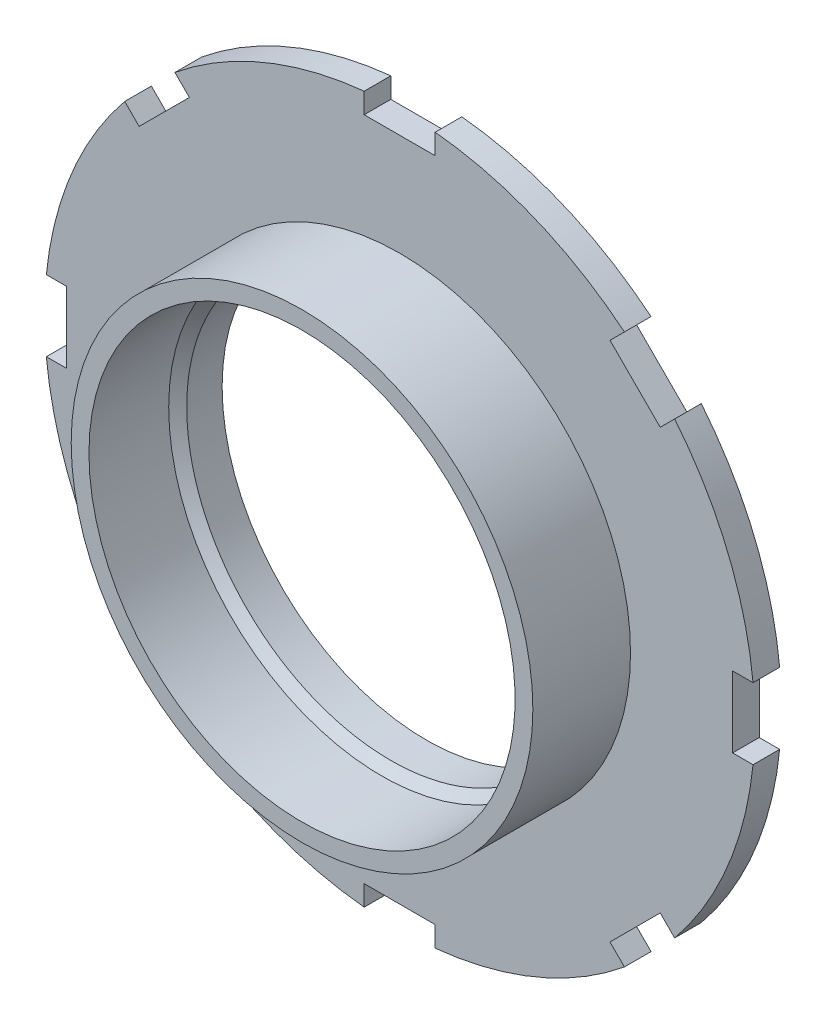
ISO-10303-21;
HEADER;
FILE_DESCRIPTION(('STEP AP214'),'2;1');
FILE_NAME('part.step','',(''),(''),'','','');
FILE_SCHEMA(('AUTOMOTIVE_DESIGN { 1 0 10303 214 1 1 1 1 }'));
ENDSEC;
DATA;
#1=APPLICATION_CONTEXT('core data for automotive mechanical design processes');
#2=APPLICATION_PROTOCOL_DEFINITION('international standard','automotive_design',2000,#1);
#3=PRODUCT_CONTEXT('',#1,'mechanical');
#4=PRODUCT('Part','Part','',(#3));
#5=PRODUCT_RELATED_PRODUCT_CATEGORY('part','',(#4));
#6=PRODUCT_DEFINITION_FORMATION('','',#4);
#7=PRODUCT_DEFINITION_CONTEXT('part definition',#1,'design');
#8=PRODUCT_DEFINITION('design','',#6,#7);
#9=PRODUCT_DEFINITION_SHAPE('','',#8);
#10=(LENGTH_UNIT() NAMED_UNIT(*) SI_UNIT(.MILLI.,.METRE.));
#11=(NAMED_UNIT(*) PLANE_ANGLE_UNIT() SI_UNIT($,.RADIAN.));
#12=(NAMED_UNIT(*) SI_UNIT($,.STERADIAN.) SOLID_ANGLE_UNIT());
#13=UNCERTAINTY_MEASURE_WITH_UNIT(LENGTH_MEASURE(1.E-05),#10,'distance_accuracy_value','');
#14=(GEOMETRIC_REPRESENTATION_CONTEXT(3) GLOBAL_UNCERTAINTY_ASSIGNED_CONTEXT((#13)) GLOBAL_UNIT_ASSIGNED_CONTEXT((#10,
#11,#12)) REPRESENTATION_CONTEXT('',''));
#15=CARTESIAN_POINT('',(0.,0.,0.));
#16=DIRECTION('',(0.,0.,1.));
#17=DIRECTION('',(1.,0.,0.));
#18=AXIS2_PLACEMENT_3D('',#15,#16,#17);
#19=CARTESIAN_POINT('',(0.,0.,14.));
#20=DIRECTION('',(0.,0.,-1.));
#21=DIRECTION('',(-1.,0.,0.));
#22=AXIS2_PLACEMENT_3D('',#19,#20,#21);
#23=CYLINDRICAL_SURFACE('',#22,24.);
#24=CARTESIAN_POINT('',(0.,0.,14.));
#25=DIRECTION('',(0.,0.,-1.));
#26=DIRECTION('',(-1.,0.,0.));
#27=AXIS2_PLACEMENT_3D('',#24,#25,#26);
#28=CIRCLE('',#27,24.);
#29=CARTESIAN_POINT('',(-24.,0.,14.));
#30=VERTEX_POINT('',#29);
#31=EDGE_CURVE('E414',#30,#30,#28,.T.);
#32=CARTESIAN_POINT('',(0.,0.,5.01666609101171));
#33=DIRECTION('',(0.,0.,1.));
#34=DIRECTION('',(1.,0.,0.));
#35=AXIS2_PLACEMENT_3D('',#32,#33,#34);
#36=CIRCLE('',#35,24.);
#37=CARTESIAN_POINT('',(-24.,0.,5.01666609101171));
#38=VERTEX_POINT('',#37);
#39=EDGE_CURVE('E11',#38,#38,#36,.T.);
#40=CARTESIAN_POINT('',(-24.,0.,14.));
#41=CARTESIAN_POINT('',(-24.,0.,13.9064236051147));
#42=CARTESIAN_POINT('',(-24.,0.,13.8128472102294));
#43=CARTESIAN_POINT('',(-24.,0.,13.6256944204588));
#44=CARTESIAN_POINT('',(-24.,0.,13.5321180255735));
#45=CARTESIAN_POINT('',(-24.,0.,13.3449652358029));
#46=CARTESIAN_POINT('',(-24.,0.,13.2513888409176));
#47=CARTESIAN_POINT('',(-24.,0.,13.0642360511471));
#48=CARTESIAN_POINT('',(-24.,0.,12.9706596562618));
#49=CARTESIAN_POINT('',(-24.,0.,12.7835068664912));
#50=CARTESIAN_POINT('',(-24.,0.,12.6899304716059));
#51=CARTESIAN_POINT('',(-24.,0.,12.5027776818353));
#52=CARTESIAN_POINT('',(-24.,0.,12.40920128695));
#53=CARTESIAN_POINT('',(-24.,0.,12.2220484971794));
#54=CARTESIAN_POINT('',(-24.,0.,12.1284721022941));
#55=CARTESIAN_POINT('',(-24.,0.,11.9413193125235));
#56=CARTESIAN_POINT('',(-24.,0.,11.8477429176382));
#57=CARTESIAN_POINT('',(-24.,0.,11.6605901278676));
#58=CARTESIAN_POINT('',(-24.,0.,11.5670137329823));
#59=CARTESIAN_POINT('',(-24.,0.,11.3798609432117));
#60=CARTESIAN_POINT('',(-24.,0.,11.2862845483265));
#61=CARTESIAN_POINT('',(-24.,0.,11.0991317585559));
#62=CARTESIAN_POINT('',(-24.,0.,11.0055553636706));
#63=CARTESIAN_POINT('',(-24.,0.,10.8184025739));
#64=CARTESIAN_POINT('',(-24.,0.,10.7248261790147));
#65=CARTESIAN_POINT('',(-24.,0.,10.5376733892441));
#66=CARTESIAN_POINT('',(-24.,0.,10.4440969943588));
#67=CARTESIAN_POINT('',(-24.,0.,10.2569442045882));
#68=CARTESIAN_POINT('',(-24.,0.,10.1633678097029));
#69=CARTESIAN_POINT('',(-24.,0.,9.97621501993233));
#70=CARTESIAN_POINT('',(-24.,0.,9.88263862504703));
#71=CARTESIAN_POINT('',(-24.,0.,9.69548583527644));
#72=CARTESIAN_POINT('',(-24.,0.,9.60190944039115));
#73=CARTESIAN_POINT('',(-24.,0.,9.41475665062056));
#74=CARTESIAN_POINT('',(-24.,0.,9.32118025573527));
#75=CARTESIAN_POINT('',(-24.,0.,9.13402746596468));
#76=CARTESIAN_POINT('',(-24.,0.,9.04045107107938));
#77=CARTESIAN_POINT('',(-24.,0.,8.85329828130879));
#78=CARTESIAN_POINT('',(-24.,0.,8.7597218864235));
#79=CARTESIAN_POINT('',(-24.,0.,8.57256909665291));
#80=CARTESIAN_POINT('',(-24.,0.,8.47899270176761));
#81=CARTESIAN_POINT('',(-24.,0.,8.29183991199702));
#82=CARTESIAN_POINT('',(-24.,0.,8.19826351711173));
#83=CARTESIAN_POINT('',(-24.,0.,8.01111072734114));
#84=CARTESIAN_POINT('',(-24.,0.,7.91753433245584));
#85=CARTESIAN_POINT('',(-24.,0.,7.73038154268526));
#86=CARTESIAN_POINT('',(-24.,0.,7.63680514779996));
#87=CARTESIAN_POINT('',(-24.,0.,7.44965235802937));
#88=CARTESIAN_POINT('',(-24.,0.,7.35607596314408));
#89=CARTESIAN_POINT('',(-24.,0.,7.16892317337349));
#90=CARTESIAN_POINT('',(-24.,0.,7.07534677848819));
#91=CARTESIAN_POINT('',(-24.,0.,6.8881939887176));
#92=CARTESIAN_POINT('',(-24.,0.,6.79461759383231));
#93=CARTESIAN_POINT('',(-24.,0.,6.60746480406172));
#94=CARTESIAN_POINT('',(-24.,0.,6.51388840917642));
#95=CARTESIAN_POINT('',(-24.,0.,6.32673561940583));
#96=CARTESIAN_POINT('',(-24.,0.,6.23315922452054));
#97=CARTESIAN_POINT('',(-24.,0.,6.04600643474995));
#98=CARTESIAN_POINT('',(-24.,0.,5.95243003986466));
#99=CARTESIAN_POINT('',(-24.,0.,5.76527725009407));
#100=CARTESIAN_POINT('',(-24.,0.,5.67170085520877));
#101=CARTESIAN_POINT('',(-24.,0.,5.48454806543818));
#102=CARTESIAN_POINT('',(-24.,0.,5.39097167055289));
#103=CARTESIAN_POINT('',(-24.,0.,5.2038188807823));
#104=CARTESIAN_POINT('',(-24.,0.,5.110242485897));
#105=CARTESIAN_POINT('',(-24.,0.,5.01666609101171));
#106=B_SPLINE_CURVE_WITH_KNOTS('',3,(#40,#41,#42,#43,#44,#45,#46,#47,#48,#49,#50,#51,#52,#53,
#54,#55,#56,#57,#58,#59,#60,#61,#62,#63,#64,#65,#66,#67,#68,#69,#70,#71,#72,#73,#74,#75,#76,#77,
#78,#79,#80,#81,#82,#83,#84,#85,#86,#87,#88,#89,#90,#91,#92,#93,#94,#95,#96,#97,#98,#99,#100,
#101,#102,#103,#104,#105),.UNSPECIFIED.,.F.,.F.,(4,2,2,2,2,2,2,2,2,2,2,2,2,2,2,2,2,2,2,2,2,2,2,
2,2,2,2,2,2,2,2,2,4),(0.,0.280729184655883,0.561458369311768,0.842187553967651,1.12291673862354,
1.40364592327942,1.6843751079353,1.96510429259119,2.24583347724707,2.52656266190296,
2.80729184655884,3.08802103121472,3.36875021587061,3.64947940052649,3.93020858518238,
4.21093776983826,4.49166695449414,4.77239613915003,5.05312532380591,5.3338545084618,
5.61458369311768,5.89531287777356,6.17604206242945,6.45677124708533,6.73750043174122,
7.0182296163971,7.29895880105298,7.57968798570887,7.86041717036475,8.14114635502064,
8.42187553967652,8.7026047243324,8.98333390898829),.UNSPECIFIED.);
#107=EDGE_CURVE('BSEAM31',#30,#38,#106,.T.);
#108=ORIENTED_EDGE('',*,*,#31,.F.);
#109=ORIENTED_EDGE('',*,*,#39,.F.);
#110=ORIENTED_EDGE('',*,*,#107,.T.);
#111=ORIENTED_EDGE('',*,*,#107,.F.);
#112=EDGE_LOOP('',(#108,#110,#109,#111));
#113=FACE_BOUND('',#112,.T.);
#114=ADVANCED_FACE('F31',(#113),#23,.F.);
#115=CARTESIAN_POINT('',(0.,0.,3.));
#116=DIRECTION('',(0.,0.,1.));
#117=DIRECTION('',(1.,0.,0.));
#118=AXIS2_PLACEMENT_3D('',#115,#116,#117);
#119=PLANE('',#118);
#120=CARTESIAN_POINT('',(0.,0.,3.));
#121=DIRECTION('',(0.,0.,1.));
#122=DIRECTION('',(1.,0.,0.));
#123=AXIS2_PLACEMENT_3D('',#120,#121,#122);
#124=CIRCLE('',#123,26.);
#125=CARTESIAN_POINT('',(26.,0.,3.));
#126=VERTEX_POINT('',#125);
#127=EDGE_CURVE('E417',#126,#126,#124,.T.);
#128=ORIENTED_EDGE('',*,*,#127,.F.);
#129=EDGE_LOOP('',(#128));
#130=FACE_BOUND('',#129,.T.);
#131=CARTESIAN_POINT('',(0.,0.,3.));
#132=DIRECTION('',(0.,0.,1.));
#133=DIRECTION('',(1.,0.,0.));
#134=AXIS2_PLACEMENT_3D('',#131,#132,#133);
#135=CIRCLE('',#134,40.);
#136=CARTESIAN_POINT('',(-4.,39.7994974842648,3.));
#137=VERTEX_POINT('',#136);
#138=CARTESIAN_POINT('',(-25.314067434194,30.9709216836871,3.));
#139=VERTEX_POINT('',#138);
#140=EDGE_CURVE('E425',#137,#139,#135,.T.);
#141=ORIENTED_EDGE('',*,*,#140,.T.);
#142=DIRECTION('',(0.707106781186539,-0.707106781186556,0.));
#143=VECTOR('',#142,1.);
#144=CARTESIAN_POINT('',(2.82842712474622,2.82842712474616,3.));
#145=LINE('',#144,#143);
#146=CARTESIAN_POINT('',(-23.688077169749,29.344931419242,3.));
#147=VERTEX_POINT('',#146);
#148=EDGE_CURVE('E46',#139,#147,#145,.T.);
#149=ORIENTED_EDGE('',*,*,#148,.T.);
#150=DIRECTION('',(-0.707106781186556,-0.707106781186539,0.));
#151=VECTOR('',#150,1.);
#152=CARTESIAN_POINT('',(-26.5165042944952,26.5165042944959,3.));
#153=LINE('',#152,#151);
#154=CARTESIAN_POINT('',(-29.3449314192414,23.6880771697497,3.));
#155=VERTEX_POINT('',#154);
#156=EDGE_CURVE('E50',#147,#155,#153,.T.);
#157=ORIENTED_EDGE('',*,*,#156,.T.);
#158=DIRECTION('',(-0.707106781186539,0.707106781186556,0.));
#159=VECTOR('',#158,1.);
#160=CARTESIAN_POINT('',(-2.82842712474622,-2.82842712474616,3.));
#161=LINE('',#160,#159);
#162=CARTESIAN_POINT('',(-30.9709216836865,25.3140674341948,3.));
#163=VERTEX_POINT('',#162);
#164=EDGE_CURVE('E282',#155,#163,#161,.T.);
#165=ORIENTED_EDGE('',*,*,#164,.T.);
#166=CARTESIAN_POINT('',(-39.7994974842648,4.00000000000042,3.));
#167=VERTEX_POINT('',#166);
#168=EDGE_CURVE('E257',#163,#167,#135,.T.);
#169=ORIENTED_EDGE('',*,*,#168,.T.);
#170=DIRECTION('',(1.,0.,0.));
#171=VECTOR('',#170,1.);
#172=CARTESIAN_POINT('',(0.,4.,3.));
#173=LINE('',#172,#171);
#174=CARTESIAN_POINT('',(-37.5,4.00000000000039,3.));
#175=VERTEX_POINT('',#174);
#176=EDGE_CURVE('E304',#167,#175,#173,.T.);
#177=ORIENTED_EDGE('',*,*,#176,.T.);
#178=DIRECTION('',(0.,-1.,0.));
#179=VECTOR('',#178,1.);
#180=CARTESIAN_POINT('',(-37.5,3.92791878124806E-13,3.));
#181=LINE('',#180,#179);
#182=CARTESIAN_POINT('',(-37.5,-3.99999999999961,3.));
#183=VERTEX_POINT('',#182);
#184=EDGE_CURVE('E302',#175,#183,#181,.T.);
#185=ORIENTED_EDGE('',*,*,#184,.T.);
#186=DIRECTION('',(-1.,0.,0.));
#187=VECTOR('',#186,1.);
#188=CARTESIAN_POINT('',(0.,-4.,3.));
#189=LINE('',#188,#187);
#190=CARTESIAN_POINT('',(-39.7994974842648,-3.99999999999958,3.));
#191=VERTEX_POINT('',#190);
#192=EDGE_CURVE('E300',#183,#191,#189,.T.);
#193=ORIENTED_EDGE('',*,*,#192,.T.);
#194=CARTESIAN_POINT('',(-30.970921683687,-25.3140674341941,3.));
#195=VERTEX_POINT('',#194);
#196=EDGE_CURVE('E495',#191,#195,#135,.T.);
#197=ORIENTED_EDGE('',*,*,#196,.T.);
#198=DIRECTION('',(0.707106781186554,0.707106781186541,0.));
#199=VECTOR('',#198,1.);
#200=CARTESIAN_POINT('',(-2.82842712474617,2.82842712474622,3.));
#201=LINE('',#200,#199);
#202=CARTESIAN_POINT('',(-29.3449314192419,-23.6880771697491,3.));
#203=VERTEX_POINT('',#202);
#204=EDGE_CURVE('E322',#195,#203,#201,.T.);
#205=ORIENTED_EDGE('',*,*,#204,.T.);
#206=DIRECTION('',(0.707106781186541,-0.707106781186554,0.));
#207=VECTOR('',#206,1.);
#208=CARTESIAN_POINT('',(-26.5165042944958,-26.5165042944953,3.));
#209=LINE('',#208,#207);
#210=CARTESIAN_POINT('',(-23.6880771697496,-29.3449314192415,3.));
#211=VERTEX_POINT('',#210);
#212=EDGE_CURVE('E320',#203,#211,#209,.T.);
#213=ORIENTED_EDGE('',*,*,#212,.T.);
#214=DIRECTION('',(-0.707106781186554,-0.707106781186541,0.));
#215=VECTOR('',#214,1.);
#216=CARTESIAN_POINT('',(2.82842712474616,-2.82842712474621,3.));
#217=LINE('',#216,#215);
#218=CARTESIAN_POINT('',(-25.3140674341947,-30.9709216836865,3.));
#219=VERTEX_POINT('',#218);
#220=EDGE_CURVE('E318',#211,#219,#217,.T.);
#221=ORIENTED_EDGE('',*,*,#220,.T.);
#222=CARTESIAN_POINT('',(-4.00000000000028,-39.7994974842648,3.));
#223=VERTEX_POINT('',#222);
#224=EDGE_CURVE('E500',#219,#223,#135,.T.);
#225=ORIENTED_EDGE('',*,*,#224,.T.);
#226=DIRECTION('',(0.,1.,0.));
#227=VECTOR('',#226,1.);
#228=CARTESIAN_POINT('',(-4.,0.,3.));
#229=LINE('',#228,#227);
#230=CARTESIAN_POINT('',(-4.00000000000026,-37.5,3.));
#231=VERTEX_POINT('',#230);
#232=EDGE_CURVE('E340',#223,#231,#229,.T.);
#233=ORIENTED_EDGE('',*,*,#232,.T.);
#234=DIRECTION('',(1.,0.,0.));
#235=VECTOR('',#234,1.);
#236=CARTESIAN_POINT('',(-2.61861252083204E-13,-37.5,3.));
#237=LINE('',#236,#235);
#238=CARTESIAN_POINT('',(3.99999999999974,-37.5,3.));
#239=VERTEX_POINT('',#238);
#240=EDGE_CURVE('E338',#231,#239,#237,.T.);
#241=ORIENTED_EDGE('',*,*,#240,.T.);
#242=DIRECTION('',(0.,-1.,0.));
#243=VECTOR('',#242,1.);
#244=CARTESIAN_POINT('',(4.,0.,3.));
#245=LINE('',#244,#243);
#246=CARTESIAN_POINT('',(3.99999999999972,-39.7994974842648,3.));
#247=VERTEX_POINT('',#246);
#248=EDGE_CURVE('E336',#239,#247,#245,.T.);
#249=ORIENTED_EDGE('',*,*,#248,.T.);
#250=CARTESIAN_POINT('',(25.3140674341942,-30.9709216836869,3.));
#251=VERTEX_POINT('',#250);
#252=EDGE_CURVE('E501',#247,#251,#135,.T.);
#253=ORIENTED_EDGE('',*,*,#252,.T.);
#254=DIRECTION('',(-0.707106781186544,0.707106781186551,0.));
#255=VECTOR('',#254,1.);
#256=CARTESIAN_POINT('',(-2.8284271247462,-2.82842712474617,3.));
#257=LINE('',#256,#255);
#258=CARTESIAN_POINT('',(23.6880771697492,-29.3449314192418,3.));
#259=VERTEX_POINT('',#258);
#260=EDGE_CURVE('E358',#251,#259,#257,.T.);
#261=ORIENTED_EDGE('',*,*,#260,.T.);
#262=DIRECTION('',(0.707106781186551,0.707106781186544,0.));
#263=VECTOR('',#262,1.);
#264=CARTESIAN_POINT('',(26.5165042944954,-26.5165042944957,3.));
#265=LINE('',#264,#263);
#266=CARTESIAN_POINT('',(29.3449314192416,-23.6880771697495,3.));
#267=VERTEX_POINT('',#266);
#268=EDGE_CURVE('E356',#259,#267,#265,.T.);
#269=ORIENTED_EDGE('',*,*,#268,.T.);
#270=DIRECTION('',(0.707106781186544,-0.707106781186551,0.));
#271=VECTOR('',#270,1.);
#272=CARTESIAN_POINT('',(2.82842712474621,2.82842712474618,3.));
#273=LINE('',#272,#271);
#274=CARTESIAN_POINT('',(30.9709216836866,-25.3140674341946,3.));
#275=VERTEX_POINT('',#274);
#276=EDGE_CURVE('E354',#267,#275,#273,.T.);
#277=ORIENTED_EDGE('',*,*,#276,.T.);
#278=CARTESIAN_POINT('',(39.7994974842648,-4.00000000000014,3.));
#279=VERTEX_POINT('',#278);
#280=EDGE_CURVE('E503',#275,#279,#135,.T.);
#281=ORIENTED_EDGE('',*,*,#280,.T.);
#282=DIRECTION('',(-1.,0.,0.));
#283=VECTOR('',#282,1.);
#284=CARTESIAN_POINT('',(0.,-4.,3.));
#285=LINE('',#284,#283);
#286=CARTESIAN_POINT('',(37.5,-4.00000000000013,3.));
#287=VERTEX_POINT('',#286);
#288=EDGE_CURVE('E376',#279,#287,#285,.T.);
#289=ORIENTED_EDGE('',*,*,#288,.T.);
#290=DIRECTION('',(0.,1.,0.));
#291=VECTOR('',#290,1.);
#292=CARTESIAN_POINT('',(37.5,-1.30930626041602E-13,3.));
#293=LINE('',#292,#291);
#294=CARTESIAN_POINT('',(37.5,3.99999999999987,3.));
#295=VERTEX_POINT('',#294);
#296=EDGE_CURVE('E374',#287,#295,#293,.T.);
#297=ORIENTED_EDGE('',*,*,#296,.T.);
#298=DIRECTION('',(1.,0.,0.));
#299=VECTOR('',#298,1.);
#300=CARTESIAN_POINT('',(0.,4.,3.));
#301=LINE('',#300,#299);
#302=CARTESIAN_POINT('',(39.7994974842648,3.99999999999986,3.));
#303=VERTEX_POINT('',#302);
#304=EDGE_CURVE('E372',#295,#303,#301,.T.);
#305=ORIENTED_EDGE('',*,*,#304,.T.);
#306=CARTESIAN_POINT('',(30.9709216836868,25.3140674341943,3.));
#307=VERTEX_POINT('',#306);
#308=EDGE_CURVE('E505',#303,#307,#135,.T.);
#309=ORIENTED_EDGE('',*,*,#308,.T.);
#310=DIRECTION('',(-0.707106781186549,-0.707106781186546,0.));
#311=VECTOR('',#310,1.);
#312=CARTESIAN_POINT('',(2.82842712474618,-2.82842712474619,3.));
#313=LINE('',#312,#311);
#314=CARTESIAN_POINT('',(29.3449314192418,23.6880771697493,3.));
#315=VERTEX_POINT('',#314);
#316=EDGE_CURVE('E394',#307,#315,#313,.T.);
#317=ORIENTED_EDGE('',*,*,#316,.T.);
#318=DIRECTION('',(-0.707106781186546,0.707106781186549,0.));
#319=VECTOR('',#318,1.);
#320=CARTESIAN_POINT('',(26.5165042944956,26.5165042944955,3.));
#321=LINE('',#320,#319);
#322=CARTESIAN_POINT('',(23.6880771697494,29.3449314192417,3.));
#323=VERTEX_POINT('',#322);
#324=EDGE_CURVE('E392',#315,#323,#321,.T.);
#325=ORIENTED_EDGE('',*,*,#324,.T.);
#326=DIRECTION('',(0.707106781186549,0.707106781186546,0.));
#327=VECTOR('',#326,1.);
#328=CARTESIAN_POINT('',(-2.82842712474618,2.82842712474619,3.));
#329=LINE('',#328,#327);
#330=CARTESIAN_POINT('',(25.3140674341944,30.9709216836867,3.));
#331=VERTEX_POINT('',#330);
#332=EDGE_CURVE('E390',#323,#331,#329,.T.);
#333=ORIENTED_EDGE('',*,*,#332,.T.);
#334=CARTESIAN_POINT('',(4.,39.7994974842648,3.));
#335=VERTEX_POINT('',#334);
#336=EDGE_CURVE('E424',#331,#335,#135,.T.);
#337=ORIENTED_EDGE('',*,*,#336,.T.);
#338=DIRECTION('',(0.,-1.,0.));
#339=VECTOR('',#338,1.);
#340=CARTESIAN_POINT('',(4.,0.,3.));
#341=LINE('',#340,#339);
#342=CARTESIAN_POINT('',(4.,37.5,3.));
#343=VERTEX_POINT('',#342);
#344=EDGE_CURVE('E412',#335,#343,#341,.T.);
#345=ORIENTED_EDGE('',*,*,#344,.T.);
#346=DIRECTION('',(-1.,0.,0.));
#347=VECTOR('',#346,1.);
#348=CARTESIAN_POINT('',(0.,37.5,3.));
#349=LINE('',#348,#347);
#350=CARTESIAN_POINT('',(-4.,37.5,3.));
#351=VERTEX_POINT('',#350);
#352=EDGE_CURVE('E410',#343,#351,#349,.T.);
#353=ORIENTED_EDGE('',*,*,#352,.T.);
#354=DIRECTION('',(0.,1.,0.));
#355=VECTOR('',#354,1.);
#356=CARTESIAN_POINT('',(-4.,0.,3.));
#357=LINE('',#356,#355);
#358=EDGE_CURVE('E408',#351,#137,#357,.T.);
#359=ORIENTED_EDGE('',*,*,#358,.T.);
#360=EDGE_LOOP('',(#141,#149,#157,#165,#169,#177,#185,#193,#197,#205,#213,#221,#225,#233,#241,
#249,#253,#261,#269,#277,#281,#289,#297,#305,#309,#317,#325,#333,#337,#345,#353,#359));
#361=FACE_BOUND('',#360,.T.);
#362=ADVANCED_FACE('F494',(#130,#361),#119,.T.);
#363=CARTESIAN_POINT('',(0.,0.,3.));
#364=DIRECTION('',(0.,0.,-1.));
#365=DIRECTION('',(-1.,0.,0.));
#366=AXIS2_PLACEMENT_3D('',#363,#364,#365);
#367=CYLINDRICAL_SURFACE('',#366,40.);
#368=DIRECTION('',(0.,0.,1.));
#369=VECTOR('',#368,1.);
#370=CARTESIAN_POINT('',(-25.314067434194,30.9709216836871,-146.074232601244));
#371=LINE('',#370,#369);
#372=CARTESIAN_POINT('',(-25.314067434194,30.9709216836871,0.));
#373=VERTEX_POINT('',#372);
#374=EDGE_CURVE('E277',#373,#139,#371,.T.);
#375=ORIENTED_EDGE('',*,*,#374,.T.);
#376=ORIENTED_EDGE('',*,*,#140,.F.);
#377=DIRECTION('',(0.,0.,1.));
#378=VECTOR('',#377,1.);
#379=CARTESIAN_POINT('',(-4.,39.7994974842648,-146.25));
#380=LINE('',#379,#378);
#381=CARTESIAN_POINT('',(-4.,39.7994974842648,0.));
#382=VERTEX_POINT('',#381);
#383=EDGE_CURVE('E397',#382,#137,#380,.T.);
#384=ORIENTED_EDGE('',*,*,#383,.F.);
#385=CARTESIAN_POINT('',(0.,0.,0.));
#386=DIRECTION('',(0.,0.,1.));
#387=DIRECTION('',(1.,0.,0.));
#388=AXIS2_PLACEMENT_3D('',#385,#386,#387);
#389=CIRCLE('',#388,40.);
#390=EDGE_CURVE('E250',#382,#373,#389,.T.);
#391=ORIENTED_EDGE('',*,*,#390,.T.);
#392=EDGE_LOOP('',(#375,#376,#384,#391));
#393=FACE_BOUND('',#392,.T.);
#394=ADVANCED_FACE('F33',(#393),#367,.T.);
#395=DIRECTION('',(0.,0.,1.));
#396=VECTOR('',#395,1.);
#397=CARTESIAN_POINT('',(-30.9709216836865,25.3140674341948,-146.074232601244));
#398=LINE('',#397,#396);
#399=CARTESIAN_POINT('',(-30.9709216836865,25.3140674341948,0.));
#400=VERTEX_POINT('',#399);
#401=EDGE_CURVE('E255',#400,#163,#398,.T.);
#402=ORIENTED_EDGE('',*,*,#401,.F.);
#403=CARTESIAN_POINT('',(-39.7994974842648,4.00000000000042,0.));
#404=VERTEX_POINT('',#403);
#405=EDGE_CURVE('E238',#400,#404,#389,.T.);
#406=ORIENTED_EDGE('',*,*,#405,.T.);
#407=DIRECTION('',(0.,0.,1.));
#408=VECTOR('',#407,1.);
#409=CARTESIAN_POINT('',(-39.7994974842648,4.00000000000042,-146.074232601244));
#410=LINE('',#409,#408);
#411=EDGE_CURVE('E298',#404,#167,#410,.T.);
#412=ORIENTED_EDGE('',*,*,#411,.T.);
#413=ORIENTED_EDGE('',*,*,#168,.F.);
#414=EDGE_LOOP('',(#402,#406,#412,#413));
#415=FACE_BOUND('',#414,.T.);
#416=ADVANCED_FACE('F256',(#415),#367,.T.);
#417=CARTESIAN_POINT('',(0.,0.,0.));
#418=DIRECTION('',(0.,0.,1.));
#419=DIRECTION('',(1.,0.,0.));
#420=AXIS2_PLACEMENT_3D('',#417,#418,#419);
#421=PLANE('',#420);
#422=DIRECTION('',(0.707106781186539,-0.707106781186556,0.));
#423=VECTOR('',#422,1.);
#424=CARTESIAN_POINT('',(2.82842712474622,2.82842712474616,0.));
#425=LINE('',#424,#423);
#426=CARTESIAN_POINT('',(-23.688077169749,29.344931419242,0.));
#427=VERTEX_POINT('',#426);
#428=EDGE_CURVE('E39',#373,#427,#425,.T.);
#429=ORIENTED_EDGE('',*,*,#428,.F.);
#430=ORIENTED_EDGE('',*,*,#390,.F.);
#431=DIRECTION('',(0.,1.,0.));
#432=VECTOR('',#431,1.);
#433=CARTESIAN_POINT('',(-4.,0.,0.));
#434=LINE('',#433,#432);
#435=CARTESIAN_POINT('',(-4.,37.5,0.));
#436=VERTEX_POINT('',#435);
#437=EDGE_CURVE('E427',#436,#382,#434,.T.);
#438=ORIENTED_EDGE('',*,*,#437,.F.);
#439=DIRECTION('',(-1.,0.,0.));
#440=VECTOR('',#439,1.);
#441=CARTESIAN_POINT('',(0.,37.5,0.));
#442=LINE('',#441,#440);
#443=CARTESIAN_POINT('',(4.,37.5,0.));
#444=VERTEX_POINT('',#443);
#445=EDGE_CURVE('E430',#444,#436,#442,.T.);
#446=ORIENTED_EDGE('',*,*,#445,.F.);
#447=DIRECTION('',(0.,-1.,0.));
#448=VECTOR('',#447,1.);
#449=CARTESIAN_POINT('',(4.,0.,0.));
#450=LINE('',#449,#448);
#451=CARTESIAN_POINT('',(4.,39.7994974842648,0.));
#452=VERTEX_POINT('',#451);
#453=EDGE_CURVE('E433',#452,#444,#450,.T.);
#454=ORIENTED_EDGE('',*,*,#453,.F.);
#455=CARTESIAN_POINT('',(25.3140674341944,30.9709216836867,0.));
#456=VERTEX_POINT('',#455);
#457=EDGE_CURVE('E422',#456,#452,#389,.T.);
#458=ORIENTED_EDGE('',*,*,#457,.F.);
#459=DIRECTION('',(0.707106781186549,0.707106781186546,0.));
#460=VECTOR('',#459,1.);
#461=CARTESIAN_POINT('',(-2.82842712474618,2.82842712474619,0.));
#462=LINE('',#461,#460);
#463=CARTESIAN_POINT('',(23.6880771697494,29.3449314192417,0.));
#464=VERTEX_POINT('',#463);
#465=EDGE_CURVE('E436',#464,#456,#462,.T.);
#466=ORIENTED_EDGE('',*,*,#465,.F.);
#467=DIRECTION('',(-0.707106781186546,0.707106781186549,0.));
#468=VECTOR('',#467,1.);
#469=CARTESIAN_POINT('',(26.5165042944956,26.5165042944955,0.));
#470=LINE('',#469,#468);
#471=CARTESIAN_POINT('',(29.3449314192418,23.6880771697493,0.));
#472=VERTEX_POINT('',#471);
#473=EDGE_CURVE('E439',#472,#464,#470,.T.);
#474=ORIENTED_EDGE('',*,*,#473,.F.);
#475=DIRECTION('',(-0.707106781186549,-0.707106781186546,0.));
#476=VECTOR('',#475,1.);
#477=CARTESIAN_POINT('',(2.82842712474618,-2.82842712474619,0.));
#478=LINE('',#477,#476);
#479=CARTESIAN_POINT('',(30.9709216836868,25.3140674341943,0.));
#480=VERTEX_POINT('',#479);
#481=EDGE_CURVE('E442',#480,#472,#478,.T.);
#482=ORIENTED_EDGE('',*,*,#481,.F.);
#483=CARTESIAN_POINT('',(39.7994974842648,3.99999999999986,0.));
#484=VERTEX_POINT('',#483);
#485=EDGE_CURVE('E529',#484,#480,#389,.T.);
#486=ORIENTED_EDGE('',*,*,#485,.F.);
#487=DIRECTION('',(1.,0.,0.));
#488=VECTOR('',#487,1.);
#489=CARTESIAN_POINT('',(0.,4.,0.));
#490=LINE('',#489,#488);
#491=CARTESIAN_POINT('',(37.5,3.99999999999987,0.));
#492=VERTEX_POINT('',#491);
#493=EDGE_CURVE('E445',#492,#484,#490,.T.);
#494=ORIENTED_EDGE('',*,*,#493,.F.);
#495=DIRECTION('',(0.,1.,0.));
#496=VECTOR('',#495,1.);
#497=CARTESIAN_POINT('',(37.5,-1.30930626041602E-13,0.));
#498=LINE('',#497,#496);
#499=CARTESIAN_POINT('',(37.5,-4.00000000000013,0.));
#500=VERTEX_POINT('',#499);
#501=EDGE_CURVE('E448',#500,#492,#498,.T.);
#502=ORIENTED_EDGE('',*,*,#501,.F.);
#503=DIRECTION('',(-1.,0.,0.));
#504=VECTOR('',#503,1.);
#505=CARTESIAN_POINT('',(0.,-4.,0.));
#506=LINE('',#505,#504);
#507=CARTESIAN_POINT('',(39.7994974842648,-4.00000000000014,0.));
#508=VERTEX_POINT('',#507);
#509=EDGE_CURVE('E451',#508,#500,#506,.T.);
#510=ORIENTED_EDGE('',*,*,#509,.F.);
#511=CARTESIAN_POINT('',(30.9709216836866,-25.3140674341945,0.));
#512=VERTEX_POINT('',#511);
#513=EDGE_CURVE('E545',#512,#508,#389,.T.);
#514=ORIENTED_EDGE('',*,*,#513,.F.);
#515=DIRECTION('',(0.707106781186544,-0.707106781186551,0.));
#516=VECTOR('',#515,1.);
#517=CARTESIAN_POINT('',(2.82842712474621,2.82842712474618,0.));
#518=LINE('',#517,#516);
#519=CARTESIAN_POINT('',(29.3449314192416,-23.6880771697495,0.));
#520=VERTEX_POINT('',#519);
#521=EDGE_CURVE('E454',#520,#512,#518,.T.);
#522=ORIENTED_EDGE('',*,*,#521,.F.);
#523=DIRECTION('',(0.707106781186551,0.707106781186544,0.));
#524=VECTOR('',#523,1.);
#525=CARTESIAN_POINT('',(26.5165042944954,-26.5165042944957,0.));
#526=LINE('',#525,#524);
#527=CARTESIAN_POINT('',(23.6880771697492,-29.3449314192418,0.));
#528=VERTEX_POINT('',#527);
#529=EDGE_CURVE('E457',#528,#520,#526,.T.);
#530=ORIENTED_EDGE('',*,*,#529,.F.);
#531=DIRECTION('',(-0.707106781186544,0.707106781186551,0.));
#532=VECTOR('',#531,1.);
#533=CARTESIAN_POINT('',(-2.8284271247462,-2.82842712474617,0.));
#534=LINE('',#533,#532);
#535=CARTESIAN_POINT('',(25.3140674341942,-30.9709216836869,0.));
#536=VERTEX_POINT('',#535);
#537=EDGE_CURVE('E460',#536,#528,#534,.T.);
#538=ORIENTED_EDGE('',*,*,#537,.F.);
#539=CARTESIAN_POINT('',(3.99999999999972,-39.7994974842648,0.));
#540=VERTEX_POINT('',#539);
#541=EDGE_CURVE('E546',#540,#536,#389,.T.);
#542=ORIENTED_EDGE('',*,*,#541,.F.);
#543=DIRECTION('',(0.,-1.,0.));
#544=VECTOR('',#543,1.);
#545=CARTESIAN_POINT('',(4.,0.,0.));
#546=LINE('',#545,#544);
#547=CARTESIAN_POINT('',(3.99999999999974,-37.5,0.));
#548=VERTEX_POINT('',#547);
#549=EDGE_CURVE('E463',#548,#540,#546,.T.);
#550=ORIENTED_EDGE('',*,*,#549,.F.);
#551=DIRECTION('',(1.,0.,0.));
#552=VECTOR('',#551,1.);
#553=CARTESIAN_POINT('',(-2.61861252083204E-13,-37.5,0.));
#554=LINE('',#553,#552);
#555=CARTESIAN_POINT('',(-4.00000000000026,-37.5,0.));
#556=VERTEX_POINT('',#555);
#557=EDGE_CURVE('E466',#556,#548,#554,.T.);
#558=ORIENTED_EDGE('',*,*,#557,.F.);
#559=DIRECTION('',(0.,1.,0.));
#560=VECTOR('',#559,1.);
#561=CARTESIAN_POINT('',(-4.,0.,0.));
#562=LINE('',#561,#560);
#563=CARTESIAN_POINT('',(-4.00000000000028,-39.7994974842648,0.));
#564=VERTEX_POINT('',#563);
#565=EDGE_CURVE('E469',#564,#556,#562,.T.);
#566=ORIENTED_EDGE('',*,*,#565,.F.);
#567=CARTESIAN_POINT('',(-25.3140674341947,-30.9709216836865,0.));
#568=VERTEX_POINT('',#567);
#569=EDGE_CURVE('E550',#568,#564,#389,.T.);
#570=ORIENTED_EDGE('',*,*,#569,.F.);
#571=DIRECTION('',(-0.707106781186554,-0.707106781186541,0.));
#572=VECTOR('',#571,1.);
#573=CARTESIAN_POINT('',(2.82842712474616,-2.82842712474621,0.));
#574=LINE('',#573,#572);
#575=CARTESIAN_POINT('',(-23.6880771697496,-29.3449314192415,0.));
#576=VERTEX_POINT('',#575);
#577=EDGE_CURVE('E472',#576,#568,#574,.T.);
#578=ORIENTED_EDGE('',*,*,#577,.F.);
#579=DIRECTION('',(0.707106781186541,-0.707106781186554,0.));
#580=VECTOR('',#579,1.);
#581=CARTESIAN_POINT('',(-26.5165042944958,-26.5165042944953,0.));
#582=LINE('',#581,#580);
#583=CARTESIAN_POINT('',(-29.3449314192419,-23.6880771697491,0.));
#584=VERTEX_POINT('',#583);
#585=EDGE_CURVE('E475',#584,#576,#582,.T.);
#586=ORIENTED_EDGE('',*,*,#585,.F.);
#587=DIRECTION('',(0.707106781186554,0.707106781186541,0.));
#588=VECTOR('',#587,1.);
#589=CARTESIAN_POINT('',(-2.82842712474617,2.82842712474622,0.));
#590=LINE('',#589,#588);
#591=CARTESIAN_POINT('',(-30.970921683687,-25.3140674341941,0.));
#592=VERTEX_POINT('',#591);
#593=EDGE_CURVE('E478',#592,#584,#590,.T.);
#594=ORIENTED_EDGE('',*,*,#593,.F.);
#595=CARTESIAN_POINT('',(-39.7994974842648,-3.99999999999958,0.));
#596=VERTEX_POINT('',#595);
#597=EDGE_CURVE('E251',#596,#592,#389,.T.);
#598=ORIENTED_EDGE('',*,*,#597,.F.);
#599=DIRECTION('',(-1.,0.,0.));
#600=VECTOR('',#599,1.);
#601=CARTESIAN_POINT('',(0.,-4.,0.));
#602=LINE('',#601,#600);
#603=CARTESIAN_POINT('',(-37.5,-3.99999999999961,0.));
#604=VERTEX_POINT('',#603);
#605=EDGE_CURVE('E481',#604,#596,#602,.T.);
#606=ORIENTED_EDGE('',*,*,#605,.F.);
#607=DIRECTION('',(0.,-1.,0.));
#608=VECTOR('',#607,1.);
#609=CARTESIAN_POINT('',(-37.5,3.92791878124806E-13,0.));
#610=LINE('',#609,#608);
#611=CARTESIAN_POINT('',(-37.5,4.00000000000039,0.));
#612=VERTEX_POINT('',#611);
#613=EDGE_CURVE('E268',#612,#604,#610,.T.);
#614=ORIENTED_EDGE('',*,*,#613,.F.);
#615=DIRECTION('',(1.,0.,0.));
#616=VECTOR('',#615,1.);
#617=CARTESIAN_POINT('',(0.,4.,0.));
#618=LINE('',#617,#616);
#619=EDGE_CURVE('E246',#404,#612,#618,.T.);
#620=ORIENTED_EDGE('',*,*,#619,.F.);
#621=ORIENTED_EDGE('',*,*,#405,.F.);
#622=DIRECTION('',(-0.707106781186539,0.707106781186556,0.));
#623=VECTOR('',#622,1.);
#624=CARTESIAN_POINT('',(-2.82842712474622,-2.82842712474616,0.));
#625=LINE('',#624,#623);
#626=CARTESIAN_POINT('',(-29.3449314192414,23.6880771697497,0.));
#627=VERTEX_POINT('',#626);
#628=EDGE_CURVE('E243',#627,#400,#625,.T.);
#629=ORIENTED_EDGE('',*,*,#628,.F.);
#630=DIRECTION('',(-0.707106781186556,-0.707106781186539,0.));
#631=VECTOR('',#630,1.);
#632=CARTESIAN_POINT('',(-26.5165042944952,26.5165042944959,0.));
#633=LINE('',#632,#631);
#634=EDGE_CURVE('E265',#427,#627,#633,.T.);
#635=ORIENTED_EDGE('',*,*,#634,.F.);
#636=EDGE_LOOP('',(#429,#430,#438,#446,#454,#458,#466,#474,#482,#486,#494,#502,#510,#514,#522,
#530,#538,#542,#550,#558,#566,#570,#578,#586,#594,#598,#606,#614,#620,#621,#629,#635));
#637=FACE_BOUND('',#636,.T.);
#638=CARTESIAN_POINT('',(0.,0.,0.));
#639=DIRECTION('',(0.,0.,-1.));
#640=DIRECTION('',(-1.,0.,0.));
#641=AXIS2_PLACEMENT_3D('',#638,#639,#640);
#642=CIRCLE('',#641,23.);
#643=CARTESIAN_POINT('',(-23.,0.,0.));
#644=VERTEX_POINT('',#643);
#645=EDGE_CURVE('E820',#644,#644,#642,.T.);
#646=ORIENTED_EDGE('',*,*,#645,.F.);
#647=EDGE_LOOP('',(#646));
#648=FACE_BOUND('',#647,.T.);
#649=ADVANCED_FACE('F240',(#637,#648),#421,.F.);
#650=DIRECTION('',(0.,0.,1.));
#651=VECTOR('',#650,1.);
#652=CARTESIAN_POINT('',(-39.7994974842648,-3.99999999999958,-146.074232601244));
#653=LINE('',#652,#651);
#654=EDGE_CURVE('E290',#596,#191,#653,.T.);
#655=ORIENTED_EDGE('',*,*,#654,.F.);
#656=ORIENTED_EDGE('',*,*,#597,.T.);
#657=DIRECTION('',(0.,0.,1.));
#658=VECTOR('',#657,1.);
#659=CARTESIAN_POINT('',(-30.970921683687,-25.3140674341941,-146.074232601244));
#660=LINE('',#659,#658);
#661=EDGE_CURVE('E315',#592,#195,#660,.T.);
#662=ORIENTED_EDGE('',*,*,#661,.T.);
#663=ORIENTED_EDGE('',*,*,#196,.F.);
#664=EDGE_LOOP('',(#655,#656,#662,#663));
#665=FACE_BOUND('',#664,.T.);
#666=ADVANCED_FACE('F497',(#665),#367,.T.);
#667=DIRECTION('',(0.,0.,1.));
#668=VECTOR('',#667,1.);
#669=CARTESIAN_POINT('',(-25.3140674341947,-30.9709216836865,-146.074232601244));
#670=LINE('',#669,#668);
#671=EDGE_CURVE('E307',#568,#219,#670,.T.);
#672=ORIENTED_EDGE('',*,*,#671,.F.);
#673=ORIENTED_EDGE('',*,*,#569,.T.);
#674=DIRECTION('',(0.,0.,1.));
#675=VECTOR('',#674,1.);
#676=CARTESIAN_POINT('',(-4.00000000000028,-39.7994974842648,-146.074232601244));
#677=LINE('',#676,#675);
#678=EDGE_CURVE('E333',#564,#223,#677,.T.);
#679=ORIENTED_EDGE('',*,*,#678,.T.);
#680=ORIENTED_EDGE('',*,*,#224,.F.);
#681=EDGE_LOOP('',(#672,#673,#679,#680));
#682=FACE_BOUND('',#681,.T.);
#683=ADVANCED_FACE('F568',(#682),#367,.T.);
#684=DIRECTION('',(0.,0.,1.));
#685=VECTOR('',#684,1.);
#686=CARTESIAN_POINT('',(3.99999999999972,-39.7994974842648,-146.074232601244));
#687=LINE('',#686,#685);
#688=EDGE_CURVE('E325',#540,#247,#687,.T.);
#689=ORIENTED_EDGE('',*,*,#688,.F.);
#690=ORIENTED_EDGE('',*,*,#541,.T.);
#691=DIRECTION('',(0.,0.,1.));
#692=VECTOR('',#691,1.);
#693=CARTESIAN_POINT('',(25.3140674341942,-30.9709216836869,-146.074232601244));
#694=LINE('',#693,#692);
#695=EDGE_CURVE('E351',#536,#251,#694,.T.);
#696=ORIENTED_EDGE('',*,*,#695,.T.);
#697=ORIENTED_EDGE('',*,*,#252,.F.);
#698=EDGE_LOOP('',(#689,#690,#696,#697));
#699=FACE_BOUND('',#698,.T.);
#700=ADVANCED_FACE('F581',(#699),#367,.T.);
#701=DIRECTION('',(0.,0.,1.));
#702=VECTOR('',#701,1.);
#703=CARTESIAN_POINT('',(30.9709216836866,-25.3140674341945,-146.074232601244));
#704=LINE('',#703,#702);
#705=EDGE_CURVE('E343',#512,#275,#704,.T.);
#706=ORIENTED_EDGE('',*,*,#705,.F.);
#707=ORIENTED_EDGE('',*,*,#513,.T.);
#708=DIRECTION('',(0.,0.,1.));
#709=VECTOR('',#708,1.);
#710=CARTESIAN_POINT('',(39.7994974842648,-4.00000000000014,-146.074232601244));
#711=LINE('',#710,#709);
#712=EDGE_CURVE('E369',#508,#279,#711,.T.);
#713=ORIENTED_EDGE('',*,*,#712,.T.);
#714=ORIENTED_EDGE('',*,*,#280,.F.);
#715=EDGE_LOOP('',(#706,#707,#713,#714));
#716=FACE_BOUND('',#715,.T.);
#717=ADVANCED_FACE('F594',(#716),#367,.T.);
#718=DIRECTION('',(0.,0.,1.));
#719=VECTOR('',#718,1.);
#720=CARTESIAN_POINT('',(39.7994974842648,3.99999999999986,-146.074232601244));
#721=LINE('',#720,#719);
#722=EDGE_CURVE('E361',#484,#303,#721,.T.);
#723=ORIENTED_EDGE('',*,*,#722,.F.);
#724=ORIENTED_EDGE('',*,*,#485,.T.);
#725=DIRECTION('',(0.,0.,1.));
#726=VECTOR('',#725,1.);
#727=CARTESIAN_POINT('',(30.9709216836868,25.3140674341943,-146.074232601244));
#728=LINE('',#727,#726);
#729=EDGE_CURVE('E387',#480,#307,#728,.T.);
#730=ORIENTED_EDGE('',*,*,#729,.T.);
#731=ORIENTED_EDGE('',*,*,#308,.F.);
#732=EDGE_LOOP('',(#723,#724,#730,#731));
#733=FACE_BOUND('',#732,.T.);
#734=ADVANCED_FACE('F544',(#733),#367,.T.);
#735=DIRECTION('',(0.,0.,1.));
#736=VECTOR('',#735,1.);
#737=CARTESIAN_POINT('',(25.3140674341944,30.9709216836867,-146.074232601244));
#738=LINE('',#737,#736);
#739=EDGE_CURVE('E379',#456,#331,#738,.T.);
#740=ORIENTED_EDGE('',*,*,#739,.F.);
#741=ORIENTED_EDGE('',*,*,#457,.T.);
#742=DIRECTION('',(0.,0.,1.));
#743=VECTOR('',#742,1.);
#744=CARTESIAN_POINT('',(4.,39.7994974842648,-146.25));
#745=LINE('',#744,#743);
#746=EDGE_CURVE('E405',#452,#335,#745,.T.);
#747=ORIENTED_EDGE('',*,*,#746,.T.);
#748=ORIENTED_EDGE('',*,*,#336,.F.);
#749=EDGE_LOOP('',(#740,#741,#747,#748));
#750=FACE_BOUND('',#749,.T.);
#751=ADVANCED_FACE('F515',(#750),#367,.T.);
#752=CARTESIAN_POINT('',(0.,0.,14.));
#753=DIRECTION('',(0.,0.,-1.));
#754=DIRECTION('',(-1.,0.,0.));
#755=AXIS2_PLACEMENT_3D('',#752,#753,#754);
#756=CYLINDRICAL_SURFACE('',#755,26.);
#757=CARTESIAN_POINT('',(0.,0.,14.));
#758=DIRECTION('',(0.,0.,1.));
#759=DIRECTION('',(1.,0.,0.));
#760=AXIS2_PLACEMENT_3D('',#757,#758,#759);
#761=CIRCLE('',#760,26.);
#762=CARTESIAN_POINT('',(26.,0.,14.));
#763=VERTEX_POINT('',#762);
#764=EDGE_CURVE('E420',#763,#763,#761,.T.);
#765=ORIENTED_EDGE('',*,*,#764,.F.);
#766=EDGE_LOOP('',(#765));
#767=FACE_BOUND('',#766,.T.);
#768=ORIENTED_EDGE('',*,*,#127,.T.);
#769=EDGE_LOOP('',(#768));
#770=FACE_BOUND('',#769,.T.);
#771=ADVANCED_FACE('F632',(#767,#770),#756,.T.);
#772=CARTESIAN_POINT('',(0.,0.,14.));
#773=DIRECTION('',(0.,0.,1.));
#774=DIRECTION('',(1.,0.,0.));
#775=AXIS2_PLACEMENT_3D('',#772,#773,#774);
#776=PLANE('',#775);
#777=ORIENTED_EDGE('',*,*,#31,.T.);
#778=EDGE_LOOP('',(#777));
#779=FACE_BOUND('',#778,.T.);
#780=ORIENTED_EDGE('',*,*,#764,.T.);
#781=EDGE_LOOP('',(#780));
#782=FACE_BOUND('',#781,.T.);
#783=ADVANCED_FACE('F629',(#779,#782),#776,.T.);
#784=CARTESIAN_POINT('',(4.,39.7994974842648,-146.25));
#785=DIRECTION('',(-1.,0.,0.));
#786=DIRECTION('',(0.,0.,1.));
#787=AXIS2_PLACEMENT_3D('',#784,#785,#786);
#788=PLANE('',#787);
#789=ORIENTED_EDGE('',*,*,#344,.F.);
#790=ORIENTED_EDGE('',*,*,#746,.F.);
#791=ORIENTED_EDGE('',*,*,#453,.T.);
#792=DIRECTION('',(0.,0.,1.));
#793=VECTOR('',#792,1.);
#794=CARTESIAN_POINT('',(4.,37.5,-146.25));
#795=LINE('',#794,#793);
#796=EDGE_CURVE('E400',#444,#343,#795,.T.);
#797=ORIENTED_EDGE('',*,*,#796,.T.);
#798=EDGE_LOOP('',(#789,#790,#791,#797));
#799=FACE_BOUND('',#798,.T.);
#800=ADVANCED_FACE('F518',(#799),#788,.T.);
#801=CARTESIAN_POINT('',(4.,37.5,-146.25));
#802=DIRECTION('',(0.,1.,0.));
#803=DIRECTION('',(0.,0.,1.));
#804=AXIS2_PLACEMENT_3D('',#801,#802,#803);
#805=PLANE('',#804);
#806=ORIENTED_EDGE('',*,*,#352,.F.);
#807=ORIENTED_EDGE('',*,*,#796,.F.);
#808=ORIENTED_EDGE('',*,*,#445,.T.);
#809=DIRECTION('',(0.,0.,1.));
#810=VECTOR('',#809,1.);
#811=CARTESIAN_POINT('',(-4.,37.5,-146.25));
#812=LINE('',#811,#810);
#813=EDGE_CURVE('E396',#436,#351,#812,.T.);
#814=ORIENTED_EDGE('',*,*,#813,.T.);
#815=EDGE_LOOP('',(#806,#807,#808,#814));
#816=FACE_BOUND('',#815,.T.);
#817=ADVANCED_FACE('F521',(#816),#805,.T.);
#818=CARTESIAN_POINT('',(-4.,37.5,-146.25));
#819=DIRECTION('',(1.,0.,0.));
#820=DIRECTION('',(0.,0.,-1.));
#821=AXIS2_PLACEMENT_3D('',#818,#819,#820);
#822=PLANE('',#821);
#823=ORIENTED_EDGE('',*,*,#358,.F.);
#824=ORIENTED_EDGE('',*,*,#813,.F.);
#825=ORIENTED_EDGE('',*,*,#437,.T.);
#826=ORIENTED_EDGE('',*,*,#383,.T.);
#827=EDGE_LOOP('',(#823,#824,#825,#826));
#828=FACE_BOUND('',#827,.T.);
#829=ADVANCED_FACE('F526',(#828),#822,.T.);
#830=CARTESIAN_POINT('',(30.9709216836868,25.3140674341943,-146.074232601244));
#831=DIRECTION('',(-0.707106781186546,0.707106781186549,0.));
#832=DIRECTION('',(-0.707106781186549,-0.707106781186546,0.));
#833=AXIS2_PLACEMENT_3D('',#830,#831,#832);
#834=PLANE('',#833);
#835=ORIENTED_EDGE('',*,*,#316,.F.);
#836=ORIENTED_EDGE('',*,*,#729,.F.);
#837=ORIENTED_EDGE('',*,*,#481,.T.);
#838=DIRECTION('',(0.,0.,1.));
#839=VECTOR('',#838,1.);
#840=CARTESIAN_POINT('',(29.3449314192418,23.6880771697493,-146.074232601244));
#841=LINE('',#840,#839);
#842=EDGE_CURVE('E382',#472,#315,#841,.T.);
#843=ORIENTED_EDGE('',*,*,#842,.T.);
#844=EDGE_LOOP('',(#835,#836,#837,#843));
#845=FACE_BOUND('',#844,.T.);
#846=ADVANCED_FACE('F541',(#845),#834,.T.);
#847=CARTESIAN_POINT('',(29.3449314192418,23.6880771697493,-146.074232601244));
#848=DIRECTION('',(0.707106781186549,0.707106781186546,0.));
#849=DIRECTION('',(-0.707106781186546,0.707106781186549,0.));
#850=AXIS2_PLACEMENT_3D('',#847,#848,#849);
#851=PLANE('',#850);
#852=ORIENTED_EDGE('',*,*,#324,.F.);
#853=ORIENTED_EDGE('',*,*,#842,.F.);
#854=ORIENTED_EDGE('',*,*,#473,.T.);
#855=DIRECTION('',(0.,0.,1.));
#856=VECTOR('',#855,1.);
#857=CARTESIAN_POINT('',(23.6880771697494,29.3449314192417,-146.074232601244));
#858=LINE('',#857,#856);
#859=EDGE_CURVE('E378',#464,#323,#858,.T.);
#860=ORIENTED_EDGE('',*,*,#859,.T.);
#861=EDGE_LOOP('',(#852,#853,#854,#860));
#862=FACE_BOUND('',#861,.T.);
#863=ADVANCED_FACE('F535',(#862),#851,.T.);
#864=CARTESIAN_POINT('',(23.6880771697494,29.3449314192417,-146.074232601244));
#865=DIRECTION('',(0.707106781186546,-0.707106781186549,0.));
#866=DIRECTION('',(0.707106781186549,0.707106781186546,0.));
#867=AXIS2_PLACEMENT_3D('',#864,#865,#866);
#868=PLANE('',#867);
#869=ORIENTED_EDGE('',*,*,#332,.F.);
#870=ORIENTED_EDGE('',*,*,#859,.F.);
#871=ORIENTED_EDGE('',*,*,#465,.T.);
#872=ORIENTED_EDGE('',*,*,#739,.T.);
#873=EDGE_LOOP('',(#869,#870,#871,#872));
#874=FACE_BOUND('',#873,.T.);
#875=ADVANCED_FACE('F532',(#874),#868,.T.);
#876=CARTESIAN_POINT('',(39.7994974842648,-4.00000000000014,-146.074232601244));
#877=DIRECTION('',(0.,1.,0.));
#878=DIRECTION('',(-1.,0.,0.));
#879=AXIS2_PLACEMENT_3D('',#876,#877,#878);
#880=PLANE('',#879);
#881=ORIENTED_EDGE('',*,*,#288,.F.);
#882=ORIENTED_EDGE('',*,*,#712,.F.);
#883=ORIENTED_EDGE('',*,*,#509,.T.);
#884=DIRECTION('',(0.,0.,1.));
#885=VECTOR('',#884,1.);
#886=CARTESIAN_POINT('',(37.5,-4.00000000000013,-146.074232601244));
#887=LINE('',#886,#885);
#888=EDGE_CURVE('E364',#500,#287,#887,.T.);
#889=ORIENTED_EDGE('',*,*,#888,.T.);
#890=EDGE_LOOP('',(#881,#882,#883,#889));
#891=FACE_BOUND('',#890,.T.);
#892=ADVANCED_FACE('F598',(#891),#880,.T.);
#893=CARTESIAN_POINT('',(37.5,-4.00000000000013,-146.074232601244));
#894=DIRECTION('',(1.,0.,0.));
#895=DIRECTION('',(0.,1.,0.));
#896=AXIS2_PLACEMENT_3D('',#893,#894,#895);
#897=PLANE('',#896);
#898=ORIENTED_EDGE('',*,*,#296,.F.);
#899=ORIENTED_EDGE('',*,*,#888,.F.);
#900=ORIENTED_EDGE('',*,*,#501,.T.);
#901=DIRECTION('',(0.,0.,1.));
#902=VECTOR('',#901,1.);
#903=CARTESIAN_POINT('',(37.5,3.99999999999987,-146.074232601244));
#904=LINE('',#903,#902);
#905=EDGE_CURVE('E360',#492,#295,#904,.T.);
#906=ORIENTED_EDGE('',*,*,#905,.T.);
#907=EDGE_LOOP('',(#898,#899,#900,#906));
#908=FACE_BOUND('',#907,.T.);
#909=ADVANCED_FACE('F603',(#908),#897,.T.);
#910=CARTESIAN_POINT('',(37.5,3.99999999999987,-146.074232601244));
#911=DIRECTION('',(0.,-1.,0.));
#912=DIRECTION('',(1.,0.,0.));
#913=AXIS2_PLACEMENT_3D('',#910,#911,#912);
#914=PLANE('',#913);
#915=ORIENTED_EDGE('',*,*,#304,.F.);
#916=ORIENTED_EDGE('',*,*,#905,.F.);
#917=ORIENTED_EDGE('',*,*,#493,.T.);
#918=ORIENTED_EDGE('',*,*,#722,.T.);
#919=EDGE_LOOP('',(#915,#916,#917,#918));
#920=FACE_BOUND('',#919,.T.);
#921=ADVANCED_FACE('F606',(#920),#914,.T.);
#922=CARTESIAN_POINT('',(25.3140674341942,-30.9709216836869,-146.074232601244));
#923=DIRECTION('',(0.707106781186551,0.707106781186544,0.));
#924=DIRECTION('',(-0.707106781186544,0.707106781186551,0.));
#925=AXIS2_PLACEMENT_3D('',#922,#923,#924);
#926=PLANE('',#925);
#927=ORIENTED_EDGE('',*,*,#260,.F.);
#928=ORIENTED_EDGE('',*,*,#695,.F.);
#929=ORIENTED_EDGE('',*,*,#537,.T.);
#930=DIRECTION('',(0.,0.,1.));
#931=VECTOR('',#930,1.);
#932=CARTESIAN_POINT('',(23.6880771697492,-29.3449314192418,-146.074232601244));
#933=LINE('',#932,#931);
#934=EDGE_CURVE('E346',#528,#259,#933,.T.);
#935=ORIENTED_EDGE('',*,*,#934,.T.);
#936=EDGE_LOOP('',(#927,#928,#929,#935));
#937=FACE_BOUND('',#936,.T.);
#938=ADVANCED_FACE('F585',(#937),#926,.T.);
#939=CARTESIAN_POINT('',(23.6880771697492,-29.3449314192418,-146.074232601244));
#940=DIRECTION('',(0.707106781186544,-0.707106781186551,0.));
#941=DIRECTION('',(0.707106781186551,0.707106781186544,0.));
#942=AXIS2_PLACEMENT_3D('',#939,#940,#941);
#943=PLANE('',#942);
#944=ORIENTED_EDGE('',*,*,#268,.F.);
#945=ORIENTED_EDGE('',*,*,#934,.F.);
#946=ORIENTED_EDGE('',*,*,#529,.T.);
#947=DIRECTION('',(0.,0.,1.));
#948=VECTOR('',#947,1.);
#949=CARTESIAN_POINT('',(29.3449314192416,-23.6880771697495,-146.074232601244));
#950=LINE('',#949,#948);
#951=EDGE_CURVE('E342',#520,#267,#950,.T.);
#952=ORIENTED_EDGE('',*,*,#951,.T.);
#953=EDGE_LOOP('',(#944,#945,#946,#952));
#954=FACE_BOUND('',#953,.T.);
#955=ADVANCED_FACE('F590',(#954),#943,.T.);
#956=CARTESIAN_POINT('',(29.3449314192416,-23.6880771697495,-146.074232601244));
#957=DIRECTION('',(-0.707106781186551,-0.707106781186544,0.));
#958=DIRECTION('',(0.707106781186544,-0.707106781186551,0.));
#959=AXIS2_PLACEMENT_3D('',#956,#957,#958);
#960=PLANE('',#959);
#961=ORIENTED_EDGE('',*,*,#276,.F.);
#962=ORIENTED_EDGE('',*,*,#951,.F.);
#963=ORIENTED_EDGE('',*,*,#521,.T.);
#964=ORIENTED_EDGE('',*,*,#705,.T.);
#965=EDGE_LOOP('',(#961,#962,#963,#964));
#966=FACE_BOUND('',#965,.T.);
#967=ADVANCED_FACE('F593',(#966),#960,.T.);
#968=CARTESIAN_POINT('',(-4.00000000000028,-39.7994974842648,-146.074232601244));
#969=DIRECTION('',(1.,0.,0.));
#970=DIRECTION('',(0.,1.,0.));
#971=AXIS2_PLACEMENT_3D('',#968,#969,#970);
#972=PLANE('',#971);
#973=ORIENTED_EDGE('',*,*,#232,.F.);
#974=ORIENTED_EDGE('',*,*,#678,.F.);
#975=ORIENTED_EDGE('',*,*,#565,.T.);
#976=DIRECTION('',(0.,0.,1.));
#977=VECTOR('',#976,1.);
#978=CARTESIAN_POINT('',(-4.00000000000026,-37.5,-146.074232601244));
#979=LINE('',#978,#977);
#980=EDGE_CURVE('E328',#556,#231,#979,.T.);
#981=ORIENTED_EDGE('',*,*,#980,.T.);
#982=EDGE_LOOP('',(#973,#974,#975,#981));
#983=FACE_BOUND('',#982,.T.);
#984=ADVANCED_FACE('F572',(#983),#972,.T.);
#985=CARTESIAN_POINT('',(-4.00000000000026,-37.5,-146.074232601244));
#986=DIRECTION('',(0.,-1.,0.));
#987=DIRECTION('',(1.,0.,0.));
#988=AXIS2_PLACEMENT_3D('',#985,#986,#987);
#989=PLANE('',#988);
#990=ORIENTED_EDGE('',*,*,#240,.F.);
#991=ORIENTED_EDGE('',*,*,#980,.F.);
#992=ORIENTED_EDGE('',*,*,#557,.T.);
#993=DIRECTION('',(0.,0.,1.));
#994=VECTOR('',#993,1.);
#995=CARTESIAN_POINT('',(3.99999999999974,-37.5,-146.074232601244));
#996=LINE('',#995,#994);
#997=EDGE_CURVE('E324',#548,#239,#996,.T.);
#998=ORIENTED_EDGE('',*,*,#997,.T.);
#999=EDGE_LOOP('',(#990,#991,#992,#998));
#1000=FACE_BOUND('',#999,.T.);
#1001=ADVANCED_FACE('F577',(#1000),#989,.T.);
#1002=CARTESIAN_POINT('',(3.99999999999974,-37.5,-146.074232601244));
#1003=DIRECTION('',(-1.,0.,0.));
#1004=DIRECTION('',(0.,-1.,0.));
#1005=AXIS2_PLACEMENT_3D('',#1002,#1003,#1004);
#1006=PLANE('',#1005);
#1007=ORIENTED_EDGE('',*,*,#248,.F.);
#1008=ORIENTED_EDGE('',*,*,#997,.F.);
#1009=ORIENTED_EDGE('',*,*,#549,.T.);
#1010=ORIENTED_EDGE('',*,*,#688,.T.);
#1011=EDGE_LOOP('',(#1007,#1008,#1009,#1010));
#1012=FACE_BOUND('',#1011,.T.);
#1013=ADVANCED_FACE('F580',(#1012),#1006,.T.);
#1014=CARTESIAN_POINT('',(-30.970921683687,-25.3140674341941,-146.074232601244));
#1015=DIRECTION('',(0.707106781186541,-0.707106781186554,0.));
#1016=DIRECTION('',(0.707106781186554,0.707106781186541,0.));
#1017=AXIS2_PLACEMENT_3D('',#1014,#1015,#1016);
#1018=PLANE('',#1017);
#1019=ORIENTED_EDGE('',*,*,#204,.F.);
#1020=ORIENTED_EDGE('',*,*,#661,.F.);
#1021=ORIENTED_EDGE('',*,*,#593,.T.);
#1022=DIRECTION('',(0.,0.,1.));
#1023=VECTOR('',#1022,1.);
#1024=CARTESIAN_POINT('',(-29.3449314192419,-23.6880771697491,-146.074232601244));
#1025=LINE('',#1024,#1023);
#1026=EDGE_CURVE('E310',#584,#203,#1025,.T.);
#1027=ORIENTED_EDGE('',*,*,#1026,.T.);
#1028=EDGE_LOOP('',(#1019,#1020,#1021,#1027));
#1029=FACE_BOUND('',#1028,.T.);
#1030=ADVANCED_FACE('F560',(#1029),#1018,.T.);
#1031=CARTESIAN_POINT('',(-29.3449314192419,-23.6880771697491,-146.074232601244));
#1032=DIRECTION('',(-0.707106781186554,-0.707106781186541,0.));
#1033=DIRECTION('',(0.707106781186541,-0.707106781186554,0.));
#1034=AXIS2_PLACEMENT_3D('',#1031,#1032,#1033);
#1035=PLANE('',#1034);
#1036=ORIENTED_EDGE('',*,*,#212,.F.);
#1037=ORIENTED_EDGE('',*,*,#1026,.F.);
#1038=ORIENTED_EDGE('',*,*,#585,.T.);
#1039=DIRECTION('',(0.,0.,1.));
#1040=VECTOR('',#1039,1.);
#1041=CARTESIAN_POINT('',(-23.6880771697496,-29.3449314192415,-146.074232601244));
#1042=LINE('',#1041,#1040);
#1043=EDGE_CURVE('E306',#576,#211,#1042,.T.);
#1044=ORIENTED_EDGE('',*,*,#1043,.T.);
#1045=EDGE_LOOP('',(#1036,#1037,#1038,#1044));
#1046=FACE_BOUND('',#1045,.T.);
#1047=ADVANCED_FACE('F564',(#1046),#1035,.T.);
#1048=CARTESIAN_POINT('',(-23.6880771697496,-29.3449314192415,-146.074232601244));
#1049=DIRECTION('',(-0.707106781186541,0.707106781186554,0.));
#1050=DIRECTION('',(-0.707106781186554,-0.707106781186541,0.));
#1051=AXIS2_PLACEMENT_3D('',#1048,#1049,#1050);
#1052=PLANE('',#1051);
#1053=ORIENTED_EDGE('',*,*,#220,.F.);
#1054=ORIENTED_EDGE('',*,*,#1043,.F.);
#1055=ORIENTED_EDGE('',*,*,#577,.T.);
#1056=ORIENTED_EDGE('',*,*,#671,.T.);
#1057=EDGE_LOOP('',(#1053,#1054,#1055,#1056));
#1058=FACE_BOUND('',#1057,.T.);
#1059=ADVANCED_FACE('F567',(#1058),#1052,.T.);
#1060=CARTESIAN_POINT('',(-39.7994974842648,4.00000000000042,-146.074232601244));
#1061=DIRECTION('',(0.,-1.,0.));
#1062=DIRECTION('',(1.,0.,0.));
#1063=AXIS2_PLACEMENT_3D('',#1060,#1061,#1062);
#1064=PLANE('',#1063);
#1065=ORIENTED_EDGE('',*,*,#176,.F.);
#1066=ORIENTED_EDGE('',*,*,#411,.F.);
#1067=ORIENTED_EDGE('',*,*,#619,.T.);
#1068=DIRECTION('',(0.,0.,1.));
#1069=VECTOR('',#1068,1.);
#1070=CARTESIAN_POINT('',(-37.5,4.00000000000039,-146.074232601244));
#1071=LINE('',#1070,#1069);
#1072=EDGE_CURVE('E293',#612,#175,#1071,.T.);
#1073=ORIENTED_EDGE('',*,*,#1072,.T.);
#1074=EDGE_LOOP('',(#1065,#1066,#1067,#1073));
#1075=FACE_BOUND('',#1074,.T.);
#1076=ADVANCED_FACE('F766',(#1075),#1064,.T.);
#1077=CARTESIAN_POINT('',(-37.5,4.00000000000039,-146.074232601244));
#1078=DIRECTION('',(-1.,0.,0.));
#1079=DIRECTION('',(0.,-1.,0.));
#1080=AXIS2_PLACEMENT_3D('',#1077,#1078,#1079);
#1081=PLANE('',#1080);
#1082=ORIENTED_EDGE('',*,*,#184,.F.);
#1083=ORIENTED_EDGE('',*,*,#1072,.F.);
#1084=ORIENTED_EDGE('',*,*,#613,.T.);
#1085=DIRECTION('',(0.,0.,1.));
#1086=VECTOR('',#1085,1.);
#1087=CARTESIAN_POINT('',(-37.5,-3.99999999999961,-146.074232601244));
#1088=LINE('',#1087,#1086);
#1089=EDGE_CURVE('E289',#604,#183,#1088,.T.);
#1090=ORIENTED_EDGE('',*,*,#1089,.T.);
#1091=EDGE_LOOP('',(#1082,#1083,#1084,#1090));
#1092=FACE_BOUND('',#1091,.T.);
#1093=ADVANCED_FACE('F488',(#1092),#1081,.T.);
#1094=CARTESIAN_POINT('',(-37.5,-3.99999999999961,-146.074232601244));
#1095=DIRECTION('',(0.,1.,0.));
#1096=DIRECTION('',(-1.,0.,0.));
#1097=AXIS2_PLACEMENT_3D('',#1094,#1095,#1096);
#1098=PLANE('',#1097);
#1099=ORIENTED_EDGE('',*,*,#192,.F.);
#1100=ORIENTED_EDGE('',*,*,#1089,.F.);
#1101=ORIENTED_EDGE('',*,*,#605,.T.);
#1102=ORIENTED_EDGE('',*,*,#654,.T.);
#1103=EDGE_LOOP('',(#1099,#1100,#1101,#1102));
#1104=FACE_BOUND('',#1103,.T.);
#1105=ADVANCED_FACE('F491',(#1104),#1098,.T.);
#1106=CARTESIAN_POINT('',(-25.314067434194,30.9709216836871,-146.074232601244));
#1107=DIRECTION('',(-0.707106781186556,-0.707106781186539,0.));
#1108=DIRECTION('',(0.707106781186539,-0.707106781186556,0.));
#1109=AXIS2_PLACEMENT_3D('',#1106,#1107,#1108);
#1110=PLANE('',#1109);
#1111=ORIENTED_EDGE('',*,*,#148,.F.);
#1112=ORIENTED_EDGE('',*,*,#374,.F.);
#1113=ORIENTED_EDGE('',*,*,#428,.T.);
#1114=DIRECTION('',(0.,0.,1.));
#1115=VECTOR('',#1114,1.);
#1116=CARTESIAN_POINT('',(-23.688077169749,29.344931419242,-146.074232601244));
#1117=LINE('',#1116,#1115);
#1118=EDGE_CURVE('E259',#427,#147,#1117,.T.);
#1119=ORIENTED_EDGE('',*,*,#1118,.T.);
#1120=EDGE_LOOP('',(#1111,#1112,#1113,#1119));
#1121=FACE_BOUND('',#1120,.T.);
#1122=ADVANCED_FACE('F276',(#1121),#1110,.T.);
#1123=CARTESIAN_POINT('',(-23.688077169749,29.344931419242,-146.074232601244));
#1124=DIRECTION('',(-0.707106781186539,0.707106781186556,0.));
#1125=DIRECTION('',(-0.707106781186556,-0.707106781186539,0.));
#1126=AXIS2_PLACEMENT_3D('',#1123,#1124,#1125);
#1127=PLANE('',#1126);
#1128=ORIENTED_EDGE('',*,*,#156,.F.);
#1129=ORIENTED_EDGE('',*,*,#1118,.F.);
#1130=ORIENTED_EDGE('',*,*,#634,.T.);
#1131=DIRECTION('',(0.,0.,1.));
#1132=VECTOR('',#1131,1.);
#1133=CARTESIAN_POINT('',(-29.3449314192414,23.6880771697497,-146.074232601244));
#1134=LINE('',#1133,#1132);
#1135=EDGE_CURVE('E260',#627,#155,#1134,.T.);
#1136=ORIENTED_EDGE('',*,*,#1135,.T.);
#1137=EDGE_LOOP('',(#1128,#1129,#1130,#1136));
#1138=FACE_BOUND('',#1137,.T.);
#1139=ADVANCED_FACE('F280',(#1138),#1127,.T.);
#1140=CARTESIAN_POINT('',(-29.3449314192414,23.6880771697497,-146.074232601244));
#1141=DIRECTION('',(0.707106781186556,0.707106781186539,0.));
#1142=DIRECTION('',(-0.707106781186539,0.707106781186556,0.));
#1143=AXIS2_PLACEMENT_3D('',#1140,#1141,#1142);
#1144=PLANE('',#1143);
#1145=ORIENTED_EDGE('',*,*,#164,.F.);
#1146=ORIENTED_EDGE('',*,*,#1135,.F.);
#1147=ORIENTED_EDGE('',*,*,#628,.T.);
#1148=ORIENTED_EDGE('',*,*,#401,.T.);
#1149=EDGE_LOOP('',(#1145,#1146,#1147,#1148));
#1150=FACE_BOUND('',#1149,.T.);
#1151=ADVANCED_FACE('F263',(#1150),#1144,.T.);
#1152=CARTESIAN_POINT('',(0.,0.,4.));
#1153=DIRECTION('',(0.,0.,-1.));
#1154=DIRECTION('',(-1.,0.,0.));
#1155=AXIS2_PLACEMENT_3D('',#1152,#1153,#1154);
#1156=CYLINDRICAL_SURFACE('',#1155,23.);
#1157=CARTESIAN_POINT('',(0.,0.,4.));
#1158=DIRECTION('',(0.,0.,-1.));
#1159=DIRECTION('',(-1.,0.,0.));
#1160=AXIS2_PLACEMENT_3D('',#1157,#1158,#1159);
#1161=CIRCLE('',#1160,23.);
#1162=CARTESIAN_POINT('',(-23.,0.,4.));
#1163=VERTEX_POINT('',#1162);
#1164=EDGE_CURVE('E823',#1163,#1163,#1161,.T.);
#1165=ORIENTED_EDGE('',*,*,#1164,.F.);
#1166=EDGE_LOOP('',(#1165));
#1167=FACE_BOUND('',#1166,.T.);
#1168=ORIENTED_EDGE('',*,*,#645,.T.);
#1169=EDGE_LOOP('',(#1168));
#1170=FACE_BOUND('',#1169,.T.);
#1171=ADVANCED_FACE('F801',(#1167,#1170),#1156,.F.);
#1172=CARTESIAN_POINT('',(0.,24.,4.));
#1173=DIRECTION('',(0.,0.,1.));
#1174=DIRECTION('',(1.,0.,0.));
#1175=AXIS2_PLACEMENT_3D('',#1172,#1173,#1174);
#1176=PLANE('',#1175);
#1177=CARTESIAN_POINT('',(0.,0.,4.));
#1178=DIRECTION('',(0.,0.,1.));
#1179=DIRECTION('',(1.,0.,0.));
#1180=AXIS2_PLACEMENT_3D('',#1177,#1178,#1179);
#1181=CIRCLE('',#1180,22.9833339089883);
#1182=CARTESIAN_POINT('',(22.9833339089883,0.,4.));
#1183=VERTEX_POINT('',#1182);
#1184=EDGE_CURVE('E818',#1183,#1183,#1181,.T.);
#1185=ORIENTED_EDGE('',*,*,#1184,.T.);
#1186=EDGE_LOOP('',(#1185));
#1187=FACE_BOUND('',#1186,.T.);
#1188=ORIENTED_EDGE('',*,*,#1164,.T.);
#1189=EDGE_LOOP('',(#1188));
#1190=FACE_BOUND('',#1189,.T.);
#1191=ADVANCED_FACE('F804',(#1187,#1190),#1176,.F.);
#1192=CARTESIAN_POINT('',(0.,0.,5.01666609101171));
#1193=DIRECTION('',(0.,0.,1.));
#1194=DIRECTION('',(1.,0.,0.));
#1195=AXIS2_PLACEMENT_3D('',#1192,#1193,#1194);
#1196=CONICAL_SURFACE('',#1195,24.,0.785398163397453);
#1197=ORIENTED_EDGE('',*,*,#1184,.F.);
#1198=EDGE_LOOP('',(#1197));
#1199=FACE_BOUND('',#1198,.T.);
#1200=ORIENTED_EDGE('',*,*,#39,.T.);
#1201=EDGE_LOOP('',(#1200));
#1202=FACE_BOUND('',#1201,.T.);
#1203=ADVANCED_FACE('F809',(#1199,#1202),#1196,.F.);
#1204=CLOSED_SHELL('',(#114,#362,#394,#416,#649,#666,#683,#700,#717,#734,#751,#771,#783,#800,
#817,#829,#846,#863,#875,#892,#909,#921,#938,#955,#967,#984,#1001,#1013,#1030,#1047,#1059,#1076,
#1093,#1105,#1122,#1139,#1151,#1171,#1191,#1203));
#1205=MANIFOLD_SOLID_BREP('B2',#1204);
#1206=ADVANCED_BREP_SHAPE_REPRESENTATION('',(#18,#1205),#14);
#1207=SHAPE_DEFINITION_REPRESENTATION(#9,#1206);
ENDSEC;
END-ISO-10303-21;
